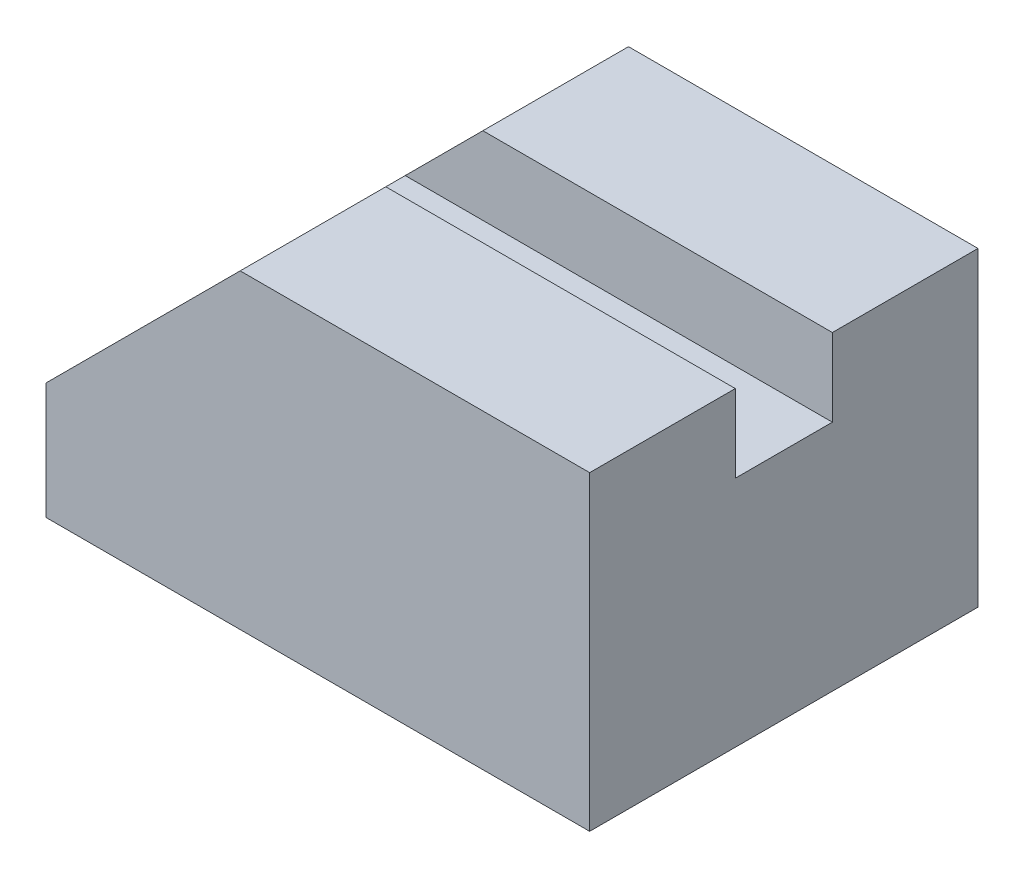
from build123d import *

# Parameters (mm, degrees)
SKETCH_1_W          = 100
SKETCH_1_H          = 80
EXTRUDE_1_DEPTH     = 140
CUT_EXTRUDE_1_REACH = 178.635
CUT_EXTRUDE_2_REACH = 155.948
SKETCH_3_W          = 25
SKETCH_3_H          = 30.701825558


with BuildPart() as part:
    # Sketch 1 → Extrude 1 (new body)
    with BuildSketch(Plane(origin=(0, 0, 0), x_dir=(0, 0, -1), z_dir=(1, 0, 0))):
        Rectangle(SKETCH_1_W, SKETCH_1_H)
    extrude(amount=EXTRUDE_1_DEPTH)

    # Sketch 2 → Cut-Extrude 1 (cut, up to next)
    with BuildSketch(Plane.XY.offset(50), mode=Mode.PRIVATE) as cut_extrude_1_sk1:
        Polygon((50, 40), (0, -10), (0, 40), (50.000459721, 40.006369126), align=None)
    cut_extrude_1_tool1 = extrude(cut_extrude_1_sk1.sketch, amount=-CUT_EXTRUDE_1_REACH, mode=Mode.PRIVATE) & part.part
    add(cut_extrude_1_tool1.solids().sort_by_distance((16.668789, 23.335456, 50))[0], mode=Mode.SUBTRACT)

    # Cut-Extrude 2: up to this plane
    cut_extrude_2_end = Plane(origin=(50, 40, -50.001), z_dir=(0.7071067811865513, -0.7071067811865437, 0))
    # Sketch 3 → Cut-Extrude 2 (cut, up to the surface)
    with BuildSketch(Plane(origin=(140, 0, 0), x_dir=(0, 0, -1), z_dir=(1, 0, 0)), mode=Mode.PRIVATE) as cut_extrude_2_sk1:
        with Locations((0, 35.350912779)):
            Rectangle(SKETCH_3_W, SKETCH_3_H)
    cut_extrude_2_tool1 = split(extrude(cut_extrude_2_sk1.sketch, amount=-CUT_EXTRUDE_2_REACH, mode=Mode.PRIVATE), bisect_by=cut_extrude_2_end, keep=Keep.BOTH, mode=Mode.PRIVATE)
    add(cut_extrude_2_tool1.solids().sort_by_distance((140, 35.350913, 0))[0], mode=Mode.SUBTRACT)


solid = part.part
